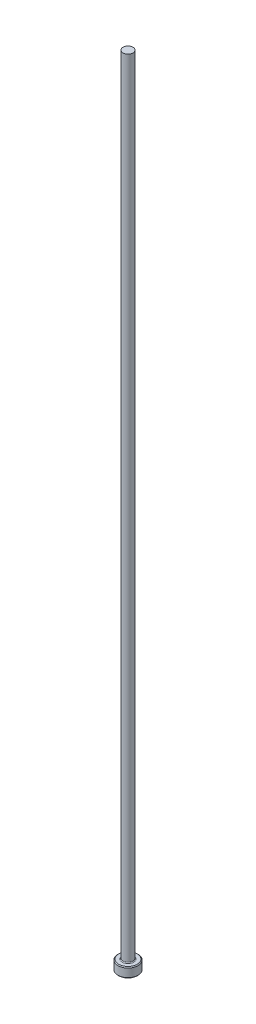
ISO-10303-21;
HEADER;
FILE_DESCRIPTION(('STEP AP214'),'2;1');
FILE_NAME('part.step','',(''),(''),'','','');
FILE_SCHEMA(('AUTOMOTIVE_DESIGN { 1 0 10303 214 1 1 1 1 }'));
ENDSEC;
DATA;
#1=APPLICATION_CONTEXT('core data for automotive mechanical design processes');
#2=APPLICATION_PROTOCOL_DEFINITION('international standard','automotive_design',2000,#1);
#3=PRODUCT_CONTEXT('',#1,'mechanical');
#4=PRODUCT('Part','Part','',(#3));
#5=PRODUCT_RELATED_PRODUCT_CATEGORY('part','',(#4));
#6=PRODUCT_DEFINITION_FORMATION('','',#4);
#7=PRODUCT_DEFINITION_CONTEXT('part definition',#1,'design');
#8=PRODUCT_DEFINITION('design','',#6,#7);
#9=PRODUCT_DEFINITION_SHAPE('','',#8);
#10=(LENGTH_UNIT() NAMED_UNIT(*) SI_UNIT(.MILLI.,.METRE.));
#11=(NAMED_UNIT(*) PLANE_ANGLE_UNIT() SI_UNIT($,.RADIAN.));
#12=(NAMED_UNIT(*) SI_UNIT($,.STERADIAN.) SOLID_ANGLE_UNIT());
#13=UNCERTAINTY_MEASURE_WITH_UNIT(LENGTH_MEASURE(1.E-05),#10,'distance_accuracy_value','');
#14=(GEOMETRIC_REPRESENTATION_CONTEXT(3) GLOBAL_UNCERTAINTY_ASSIGNED_CONTEXT((#13)) GLOBAL_UNIT_ASSIGNED_CONTEXT((#10,
#11,#12)) REPRESENTATION_CONTEXT('',''));
#15=CARTESIAN_POINT('',(0.,0.,0.));
#16=DIRECTION('',(0.,0.,1.));
#17=DIRECTION('',(1.,0.,0.));
#18=AXIS2_PLACEMENT_3D('',#15,#16,#17);
#19=CARTESIAN_POINT('',(0.,0.,0.));
#20=DIRECTION('',(0.,-1.,0.));
#21=DIRECTION('',(0.,0.,-1.));
#22=AXIS2_PLACEMENT_3D('',#19,#20,#21);
#23=PLANE('',#22);
#24=CARTESIAN_POINT('',(0.,0.,0.));
#25=DIRECTION('',(0.,-1.,0.));
#26=DIRECTION('',(0.,0.,-1.));
#27=AXIS2_PLACEMENT_3D('',#24,#25,#26);
#28=CIRCLE('',#27,2.92099999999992);
#29=CARTESIAN_POINT('',(0.,0.,-2.92099999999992));
#30=VERTEX_POINT('',#29);
#31=EDGE_CURVE('E46',#30,#30,#28,.T.);
#32=ORIENTED_EDGE('',*,*,#31,.T.);
#33=EDGE_LOOP('',(#32));
#34=FACE_BOUND('',#33,.T.);
#35=ADVANCED_FACE('F35',(#34),#23,.T.);
#36=CARTESIAN_POINT('',(0.,259.958771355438,0.));
#37=DIRECTION('',(0.,1.,0.));
#38=DIRECTION('',(0.,0.,1.));
#39=AXIS2_PLACEMENT_3D('',#36,#37,#38);
#40=CYLINDRICAL_SURFACE('',#39,3.17499999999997);
#41=CARTESIAN_POINT('',(0.,2.92100000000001,0.));
#42=DIRECTION('',(0.,1.,0.));
#43=DIRECTION('',(0.,0.,1.));
#44=AXIS2_PLACEMENT_3D('',#41,#42,#43);
#45=CIRCLE('',#44,3.17499999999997);
#46=CARTESIAN_POINT('',(0.,2.92100000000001,3.17499999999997));
#47=VERTEX_POINT('',#46);
#48=EDGE_CURVE('E50',#47,#47,#45,.F.);
#49=ORIENTED_EDGE('',*,*,#48,.T.);
#50=EDGE_LOOP('',(#49));
#51=FACE_BOUND('',#50,.T.);
#52=CARTESIAN_POINT('',(0.,0.254000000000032,0.));
#53=DIRECTION('',(0.,-1.,0.));
#54=DIRECTION('',(0.,0.,-1.));
#55=AXIS2_PLACEMENT_3D('',#52,#53,#54);
#56=CIRCLE('',#55,3.17499999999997);
#57=CARTESIAN_POINT('',(0.,0.254000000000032,-3.17499999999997));
#58=VERTEX_POINT('',#57);
#59=EDGE_CURVE('E55',#58,#58,#56,.F.);
#60=ORIENTED_EDGE('',*,*,#59,.T.);
#61=EDGE_LOOP('',(#60));
#62=FACE_BOUND('',#61,.T.);
#63=ADVANCED_FACE('F77',(#51,#62),#40,.T.);
#64=CARTESIAN_POINT('',(-3.17499999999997,3.175,0.));
#65=DIRECTION('',(0.,1.,0.));
#66=DIRECTION('',(0.,0.,1.));
#67=AXIS2_PLACEMENT_3D('',#64,#65,#66);
#68=PLANE('',#67);
#69=CARTESIAN_POINT('',(0.,3.175,0.));
#70=DIRECTION('',(0.,1.,0.));
#71=DIRECTION('',(0.,0.,1.));
#72=AXIS2_PLACEMENT_3D('',#69,#70,#71);
#73=CIRCLE('',#72,1.84149999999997);
#74=CARTESIAN_POINT('',(0.,3.175,1.84149999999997));
#75=VERTEX_POINT('',#74);
#76=EDGE_CURVE('E10',#75,#75,#73,.F.);
#77=ORIENTED_EDGE('',*,*,#76,.T.);
#78=EDGE_LOOP('',(#77));
#79=FACE_BOUND('',#78,.T.);
#80=CARTESIAN_POINT('',(0.,3.175,0.));
#81=DIRECTION('',(0.,1.,0.));
#82=DIRECTION('',(0.,0.,1.));
#83=AXIS2_PLACEMENT_3D('',#80,#81,#82);
#84=CIRCLE('',#83,2.92099999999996);
#85=CARTESIAN_POINT('',(0.,3.175,2.92099999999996));
#86=VERTEX_POINT('',#85);
#87=EDGE_CURVE('E58',#86,#86,#84,.T.);
#88=ORIENTED_EDGE('',*,*,#87,.T.);
#89=EDGE_LOOP('',(#88));
#90=FACE_BOUND('',#89,.T.);
#91=ADVANCED_FACE('F69',(#79,#90),#68,.T.);
#92=CARTESIAN_POINT('',(0.,259.958771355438,0.));
#93=DIRECTION('',(0.,1.,0.));
#94=DIRECTION('',(0.,0.,1.));
#95=AXIS2_PLACEMENT_3D('',#92,#93,#94);
#96=CYLINDRICAL_SURFACE('',#95,1.58749999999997);
#97=CARTESIAN_POINT('',(0.,3.42900000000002,0.));
#98=DIRECTION('',(0.,1.,0.));
#99=DIRECTION('',(0.,0.,1.));
#100=AXIS2_PLACEMENT_3D('',#97,#98,#99);
#101=CIRCLE('',#100,1.58749999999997);
#102=CARTESIAN_POINT('',(0.,3.42900000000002,1.58749999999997));
#103=VERTEX_POINT('',#102);
#104=EDGE_CURVE('E42',#103,#103,#101,.T.);
#105=ORIENTED_EDGE('',*,*,#104,.T.);
#106=EDGE_LOOP('',(#105));
#107=FACE_BOUND('',#106,.T.);
#108=CARTESIAN_POINT('',(0.,254.,0.));
#109=DIRECTION('',(0.,1.,0.));
#110=DIRECTION('',(0.,0.,1.));
#111=AXIS2_PLACEMENT_3D('',#108,#109,#110);
#112=CIRCLE('',#111,1.58749999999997);
#113=CARTESIAN_POINT('',(0.,254.,1.58749999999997));
#114=VERTEX_POINT('',#113);
#115=EDGE_CURVE('E61',#114,#114,#112,.T.);
#116=ORIENTED_EDGE('',*,*,#115,.F.);
#117=EDGE_LOOP('',(#116));
#118=FACE_BOUND('',#117,.T.);
#119=ADVANCED_FACE('F67',(#107,#118),#96,.T.);
#120=CARTESIAN_POINT('',(-1.58749999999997,254.,0.));
#121=DIRECTION('',(0.,1.,0.));
#122=DIRECTION('',(0.,0.,1.));
#123=AXIS2_PLACEMENT_3D('',#120,#121,#122);
#124=PLANE('',#123);
#125=ORIENTED_EDGE('',*,*,#115,.T.);
#126=EDGE_LOOP('',(#125));
#127=FACE_BOUND('',#126,.T.);
#128=ADVANCED_FACE('F65',(#127),#124,.T.);
#129=CARTESIAN_POINT('',(0.,3.17499999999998,0.));
#130=DIRECTION('',(0.,-1.,0.));
#131=DIRECTION('',(0.,0.,-1.));
#132=AXIS2_PLACEMENT_3D('',#129,#130,#131);
#133=CONICAL_SURFACE('',#132,2.92099999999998,0.785398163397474);
#134=ORIENTED_EDGE('',*,*,#48,.F.);
#135=EDGE_LOOP('',(#134));
#136=FACE_BOUND('',#135,.T.);
#137=ORIENTED_EDGE('',*,*,#87,.F.);
#138=EDGE_LOOP('',(#137));
#139=FACE_BOUND('',#138,.T.);
#140=ADVANCED_FACE('F75',(#136,#139),#133,.T.);
#141=CARTESIAN_POINT('',(0.,0.254000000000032,0.));
#142=DIRECTION('',(0.,1.,0.));
#143=DIRECTION('',(0.,0.,1.));
#144=AXIS2_PLACEMENT_3D('',#141,#142,#143);
#145=CONICAL_SURFACE('',#144,3.17499999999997,0.785398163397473);
#146=ORIENTED_EDGE('',*,*,#31,.F.);
#147=EDGE_LOOP('',(#146));
#148=FACE_BOUND('',#147,.T.);
#149=ORIENTED_EDGE('',*,*,#59,.F.);
#150=EDGE_LOOP('',(#149));
#151=FACE_BOUND('',#150,.T.);
#152=ADVANCED_FACE('F89',(#148,#151),#145,.T.);
#153=CARTESIAN_POINT('',(0.,3.42900000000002,0.));
#154=DIRECTION('',(0.,1.,0.));
#155=DIRECTION('',(0.,0.,1.));
#156=AXIS2_PLACEMENT_3D('',#153,#154,#155);
#157=TOROIDAL_SURFACE('',#156,1.84149999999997,0.254);
#158=ORIENTED_EDGE('',*,*,#76,.F.);
#159=EDGE_LOOP('',(#158));
#160=FACE_BOUND('',#159,.T.);
#161=ORIENTED_EDGE('',*,*,#104,.F.);
#162=EDGE_LOOP('',(#161));
#163=FACE_BOUND('',#162,.T.);
#164=ADVANCED_FACE('F37',(#160,#163),#157,.F.);
#165=CLOSED_SHELL('',(#35,#63,#91,#119,#128,#140,#152,#164));
#166=MANIFOLD_SOLID_BREP('B2',#165);
#167=ADVANCED_BREP_SHAPE_REPRESENTATION('',(#18,#166),#14);
#168=SHAPE_DEFINITION_REPRESENTATION(#9,#167);
ENDSEC;
END-ISO-10303-21;
